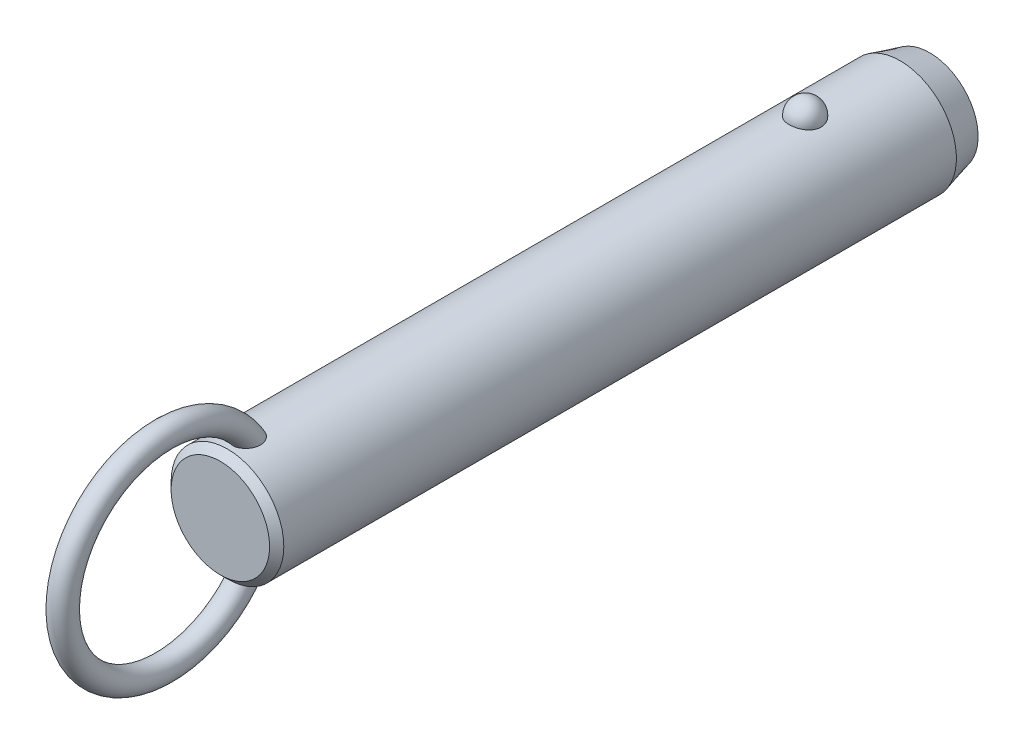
ISO-10303-21;
HEADER;
FILE_DESCRIPTION(('STEP AP214'),'2;1');
FILE_NAME('part.step','',(''),(''),'','','');
FILE_SCHEMA(('AUTOMOTIVE_DESIGN { 1 0 10303 214 1 1 1 1 }'));
ENDSEC;
DATA;
#1=APPLICATION_CONTEXT('core data for automotive mechanical design processes');
#2=APPLICATION_PROTOCOL_DEFINITION('international standard','automotive_design',2000,#1);
#3=PRODUCT_CONTEXT('',#1,'mechanical');
#4=PRODUCT('Part','Part','',(#3));
#5=PRODUCT_RELATED_PRODUCT_CATEGORY('part','',(#4));
#6=PRODUCT_DEFINITION_FORMATION('','',#4);
#7=PRODUCT_DEFINITION_CONTEXT('part definition',#1,'design');
#8=PRODUCT_DEFINITION('design','',#6,#7);
#9=PRODUCT_DEFINITION_SHAPE('','',#8);
#10=(LENGTH_UNIT() NAMED_UNIT(*) SI_UNIT(.MILLI.,.METRE.));
#11=(NAMED_UNIT(*) PLANE_ANGLE_UNIT() SI_UNIT($,.RADIAN.));
#12=(NAMED_UNIT(*) SI_UNIT($,.STERADIAN.) SOLID_ANGLE_UNIT());
#13=UNCERTAINTY_MEASURE_WITH_UNIT(LENGTH_MEASURE(1.E-05),#10,'distance_accuracy_value','');
#14=(GEOMETRIC_REPRESENTATION_CONTEXT(3) GLOBAL_UNCERTAINTY_ASSIGNED_CONTEXT((#13)) GLOBAL_UNIT_ASSIGNED_CONTEXT((#10,
#11,#12)) REPRESENTATION_CONTEXT('',''));
#15=CARTESIAN_POINT('',(0.,0.,0.));
#16=DIRECTION('',(0.,0.,1.));
#17=DIRECTION('',(1.,0.,0.));
#18=AXIS2_PLACEMENT_3D('',#15,#16,#17);
#19=CARTESIAN_POINT('',(0.,0.,86.4));
#20=DIRECTION('',(0.,0.,-1.));
#21=DIRECTION('',(-1.,0.,0.));
#22=AXIS2_PLACEMENT_3D('',#19,#20,#21);
#23=CYLINDRICAL_SURFACE('',#22,9.5);
#24=CARTESIAN_POINT('',(2.67259918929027,9.11631578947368,-2.70000000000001));
#25=CARTESIAN_POINT('',(2.6725968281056,9.11631786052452,-2.54909854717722));
#26=CARTESIAN_POINT('',(2.66030567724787,9.11994722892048,-2.39816735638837));
#27=CARTESIAN_POINT('',(2.6114347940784,9.13405924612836,-2.10058568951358));
#28=CARTESIAN_POINT('',(2.57484658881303,9.14454428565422,-1.95393672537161));
#29=CARTESIAN_POINT('',(2.47830875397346,9.17117631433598,-1.66916069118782));
#30=CARTESIAN_POINT('',(2.41836936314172,9.18732082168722,-1.53102991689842));
#31=CARTESIAN_POINT('',(2.27661331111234,9.22346780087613,-1.26705393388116));
#32=CARTESIAN_POINT('',(2.19479699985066,9.24347021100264,-1.14120852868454));
#33=CARTESIAN_POINT('',(2.01085282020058,9.28522401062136,-0.904632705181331));
#34=CARTESIAN_POINT('',(1.90862396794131,9.30698376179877,-0.793982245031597));
#35=CARTESIAN_POINT('',(1.6867437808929,9.34973971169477,-0.591607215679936));
#36=CARTESIAN_POINT('',(1.56709244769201,9.37073591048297,-0.499882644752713));
#37=CARTESIAN_POINT('',(1.31393976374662,9.40956370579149,-0.338167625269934));
#38=CARTESIAN_POINT('',(1.18048026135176,9.42740444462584,-0.268113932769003));
#39=CARTESIAN_POINT('',(0.903154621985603,9.45799906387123,-0.151390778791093));
#40=CARTESIAN_POINT('',(0.759289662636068,9.47075351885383,-0.10471867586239));
#41=CARTESIAN_POINT('',(0.46807402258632,9.48956256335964,-0.0367633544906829));
#42=CARTESIAN_POINT('',(0.320836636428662,9.49573643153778,-0.0150275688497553));
#43=CARTESIAN_POINT('',(0.02467145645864,9.50112183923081,0.00396199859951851));
#44=CARTESIAN_POINT('',(-0.124256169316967,9.50033406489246,0.00121819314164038));
#45=CARTESIAN_POINT('',(-0.417264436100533,9.4919475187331,-0.0284441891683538));
#46=CARTESIAN_POINT('',(-0.561384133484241,9.48444885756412,-0.055007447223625));
#47=CARTESIAN_POINT('',(-0.842986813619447,9.46357853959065,-0.131064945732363));
#48=CARTESIAN_POINT('',(-0.98046968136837,9.450206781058,-0.180559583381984));
#49=CARTESIAN_POINT('',(-1.24585005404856,9.41890822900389,-0.301476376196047));
#50=CARTESIAN_POINT('',(-1.37368611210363,9.40095498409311,-0.373026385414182));
#51=CARTESIAN_POINT('',(-1.61552738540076,9.36242964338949,-0.536025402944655));
#52=CARTESIAN_POINT('',(-1.72953116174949,9.34185727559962,-0.627476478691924));
#53=CARTESIAN_POINT('',(-1.9429225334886,9.29984568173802,-0.829844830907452));
#54=CARTESIAN_POINT('',(-2.04198021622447,9.27839736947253,-0.94110821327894));
#55=CARTESIAN_POINT('',(-2.2202646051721,9.23735994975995,-1.17883414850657));
#56=CARTESIAN_POINT('',(-2.29948985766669,9.21777097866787,-1.30529781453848));
#57=CARTESIAN_POINT('',(-2.43697287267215,9.18238994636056,-1.57158566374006));
#58=CARTESIAN_POINT('',(-2.49497068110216,9.16664569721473,-1.71155057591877));
#59=CARTESIAN_POINT('',(-2.5872073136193,9.14104303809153,-1.99961197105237));
#60=CARTESIAN_POINT('',(-2.62144683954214,9.13118445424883,-2.14770821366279));
#61=CARTESIAN_POINT('',(-2.66521466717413,9.11850622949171,-2.44715424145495));
#62=CARTESIAN_POINT('',(-2.67484831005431,9.11565658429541,-2.59848735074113));
#63=CARTESIAN_POINT('',(-2.66946735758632,9.11723375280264,-2.90067317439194));
#64=CARTESIAN_POINT('',(-2.65445345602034,9.12166036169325,-3.05152590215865));
#65=CARTESIAN_POINT('',(-2.60029711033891,9.13724422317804,-3.34766110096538));
#66=CARTESIAN_POINT('',(-2.56127978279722,9.14836656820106,-3.49296833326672));
#67=CARTESIAN_POINT('',(-2.46018844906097,9.17606676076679,-3.77477535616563));
#68=CARTESIAN_POINT('',(-2.39811349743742,9.1926448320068,-3.9112747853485));
#69=CARTESIAN_POINT('',(-2.25202303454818,9.22952198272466,-4.17244273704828));
#70=CARTESIAN_POINT('',(-2.16788714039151,9.24984129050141,-4.29704106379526));
#71=CARTESIAN_POINT('',(-1.9799408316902,9.29188255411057,-4.53013066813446));
#72=CARTESIAN_POINT('',(-1.87612963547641,9.31360456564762,-4.63862130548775));
#73=CARTESIAN_POINT('',(-1.65105429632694,9.35612959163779,-4.8369029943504));
#74=CARTESIAN_POINT('',(-1.52972405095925,9.37692871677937,-4.92661991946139));
#75=CARTESIAN_POINT('',(-1.27318250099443,9.41518970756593,-5.08429106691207));
#76=CARTESIAN_POINT('',(-1.13797219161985,9.432651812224,-5.15224684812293));
#77=CARTESIAN_POINT('',(-0.859280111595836,9.46208255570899,-5.26371827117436));
#78=CARTESIAN_POINT('',(-0.715925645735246,9.47411833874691,-5.30753421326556));
#79=CARTESIAN_POINT('',(-0.423550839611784,9.4916822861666,-5.37076321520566));
#80=CARTESIAN_POINT('',(-0.274531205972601,9.49721125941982,-5.39017930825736));
#81=CARTESIAN_POINT('',(0.021844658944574,9.50110860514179,-5.40390587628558));
#82=CARTESIAN_POINT('',(0.169177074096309,9.49961381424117,-5.39869609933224));
#83=CARTESIAN_POINT('',(0.460808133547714,9.48993906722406,-5.36441955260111));
#84=CARTESIAN_POINT('',(0.605106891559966,9.48175936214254,-5.33535367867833));
#85=CARTESIAN_POINT('',(0.886027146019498,9.4596376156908,-5.25435587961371));
#86=CARTESIAN_POINT('',(1.02267710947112,9.44571881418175,-5.20251612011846));
#87=CARTESIAN_POINT('',(1.28523827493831,9.41358993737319,-5.07741549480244));
#88=CARTESIAN_POINT('',(1.41114877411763,9.39537958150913,-5.00415322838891));
#89=CARTESIAN_POINT('',(1.65085227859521,9.3562644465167,-4.83684599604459));
#90=CARTESIAN_POINT('',(1.76442346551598,9.33532178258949,-4.74249218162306));
#91=CARTESIAN_POINT('',(1.97425672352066,9.29321198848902,-4.53620389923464));
#92=CARTESIAN_POINT('',(2.07051582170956,9.27204482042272,-4.42426641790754));
#93=CARTESIAN_POINT('',(2.24490086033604,9.23139221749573,-4.18363183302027));
#94=CARTESIAN_POINT('',(2.32267019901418,9.21194380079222,-4.05466990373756));
#95=CARTESIAN_POINT('',(2.45584092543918,9.1773419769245,-3.78517836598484));
#96=CARTESIAN_POINT('',(2.5112497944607,9.16218713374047,-3.64465264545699));
#97=CARTESIAN_POINT('',(2.59380876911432,9.13913522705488,-3.37104301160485));
#98=CARTESIAN_POINT('',(2.62330266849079,9.13064624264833,-3.23871053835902));
#99=CARTESIAN_POINT('',(2.66269870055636,9.11923566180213,-2.97092664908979));
#100=CARTESIAN_POINT('',(2.67260130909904,9.11631393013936,-2.83547530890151));
#101=CARTESIAN_POINT('',(2.67259918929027,9.11631578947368,-2.70000000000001));
#102=B_SPLINE_CURVE_WITH_KNOTS('',3,(#24,#25,#26,#27,#28,#29,#30,#31,#32,#33,#34,#35,#36,#37,
#38,#39,#40,#41,#42,#43,#44,#45,#46,#47,#48,#49,#50,#51,#52,#53,#54,#55,#56,#57,#58,#59,#60,#61,
#62,#63,#64,#65,#66,#67,#68,#69,#70,#71,#72,#73,#74,#75,#76,#77,#78,#79,#80,#81,#82,#83,#84,#85,
#86,#87,#88,#89,#90,#91,#92,#93,#94,#95,#96,#97,#98,#99,#100,#101),.UNSPECIFIED.,.T.,.F.,(4,2,2,
2,2,2,2,2,2,2,2,2,2,2,2,2,2,2,2,2,2,2,2,2,2,2,2,2,2,2,2,2,2,2,2,2,2,2,4),(0.,0.452217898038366,
0.904593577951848,1.35677112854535,1.80894144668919,2.26340676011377,2.71787203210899,
3.17099820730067,3.62407318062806,4.06878835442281,4.51345969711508,4.95160616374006,
5.38976021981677,5.83050358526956,6.27129275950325,6.72071308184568,7.17016633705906,
7.6249527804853,8.07972578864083,8.53254856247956,8.98535859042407,9.43582813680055,
9.88631615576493,10.3393155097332,10.7923328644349,11.2471065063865,11.7018475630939,
12.150795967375,12.599688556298,13.0398725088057,13.4800399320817,13.9184421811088,
14.3568730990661,14.802202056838,15.2476074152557,15.7010097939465,16.1542603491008,
16.5602594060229,16.966248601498),.UNSPECIFIED.);
#103=CARTESIAN_POINT('',(2.67259918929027,9.11631578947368,-2.70000000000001));
#104=VERTEX_POINT('',#103);
#105=EDGE_CURVE('E41',#104,#104,#102,.T.);
#106=ORIENTED_EDGE('',*,*,#105,.T.);
#107=EDGE_LOOP('',(#106));
#108=FACE_BOUND('',#107,.T.);
#109=CARTESIAN_POINT('',(0.,0.,94.7200000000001));
#110=DIRECTION('',(0.,0.,1.));
#111=DIRECTION('',(1.,0.,0.));
#112=AXIS2_PLACEMENT_3D('',#109,#110,#111);
#113=CIRCLE('',#112,9.5);
#114=CARTESIAN_POINT('',(9.5,0.,94.7200000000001));
#115=VERTEX_POINT('',#114);
#116=EDGE_CURVE('E10',#115,#115,#113,.F.);
#117=ORIENTED_EDGE('',*,*,#116,.T.);
#118=EDGE_LOOP('',(#117));
#119=FACE_BOUND('',#118,.T.);
#120=CARTESIAN_POINT('',(-0.697062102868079,-9.47439269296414,89.0678088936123));
#121=CARTESIAN_POINT('',(-0.799579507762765,-9.46685146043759,89.1074823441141));
#122=CARTESIAN_POINT('',(-0.898575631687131,-9.45788043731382,89.1559309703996));
#123=CARTESIAN_POINT('',(-1.08670047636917,-9.43811593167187,89.2688685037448));
#124=CARTESIAN_POINT('',(-1.17583204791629,-9.42732297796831,89.333352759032));
#125=CARTESIAN_POINT('',(-1.34179806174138,-9.40513672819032,89.4762099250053));
#126=CARTESIAN_POINT('',(-1.41865133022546,-9.39374438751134,89.5545611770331));
#127=CARTESIAN_POINT('',(-1.5586004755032,-9.37154196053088,89.7227524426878));
#128=CARTESIAN_POINT('',(-1.62169476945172,-9.3607319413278,89.8125937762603));
#129=CARTESIAN_POINT('',(-1.73527695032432,-9.34035749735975,90.0045001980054));
#130=CARTESIAN_POINT('',(-1.7852226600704,-9.33085270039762,90.1068910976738));
#131=CARTESIAN_POINT('',(-1.86924997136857,-9.3143834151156,90.318148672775));
#132=CARTESIAN_POINT('',(-1.90332570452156,-9.30741986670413,90.4270177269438));
#133=CARTESIAN_POINT('',(-1.95893603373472,-9.29588482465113,90.6604730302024));
#134=CARTESIAN_POINT('',(-1.97872420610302,-9.29165182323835,90.7854890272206));
#135=CARTESIAN_POINT('',(-2.00062129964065,-9.28695978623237,91.0370805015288));
#136=CARTESIAN_POINT('',(-2.00272284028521,-9.28650232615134,91.163656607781));
#137=CARTESIAN_POINT('',(-1.98958876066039,-9.28932750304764,91.4368157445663));
#138=CARTESIAN_POINT('',(-1.97143366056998,-9.2932400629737,91.5832519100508));
#139=CARTESIAN_POINT('',(-1.91479925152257,-9.30507151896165,91.8720629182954));
#140=CARTESIAN_POINT('',(-1.87629122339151,-9.31299607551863,92.014431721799));
#141=CARTESIAN_POINT('',(-1.77225683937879,-9.33340232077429,92.3151725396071));
#142=CARTESIAN_POINT('',(-1.70334898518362,-9.34641636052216,92.4723691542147));
#143=CARTESIAN_POINT('',(-1.58111062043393,-9.36759153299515,92.6975171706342));
#144=CARTESIAN_POINT('',(-1.53721459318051,-9.37492619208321,92.7707968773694));
#145=CARTESIAN_POINT('',(-1.44302631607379,-9.38988566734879,92.9130740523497));
#146=CARTESIAN_POINT('',(-1.39273721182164,-9.39751033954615,92.9820736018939));
#147=CARTESIAN_POINT('',(-1.26775962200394,-9.41530678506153,93.1369832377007));
#148=CARTESIAN_POINT('',(-1.19052326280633,-9.42548108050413,93.2208712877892));
#149=CARTESIAN_POINT('',(-1.02420241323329,-9.44499825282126,93.3760086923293));
#150=CARTESIAN_POINT('',(-0.935139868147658,-9.45434261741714,93.4472808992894));
#151=CARTESIAN_POINT('',(-0.766610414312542,-9.46930670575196,93.5586955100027));
#152=CARTESIAN_POINT('',(-0.689439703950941,-9.47529223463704,93.6022354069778));
#153=CARTESIAN_POINT('',(-0.528942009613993,-9.48560294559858,93.6763133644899));
#154=CARTESIAN_POINT('',(-0.445620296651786,-9.48992953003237,93.7068624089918));
#155=CARTESIAN_POINT('',(-0.273901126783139,-9.49644161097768,93.7525792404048));
#156=CARTESIAN_POINT('',(-0.185465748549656,-9.49860811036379,93.76761059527));
#157=CARTESIAN_POINT('',(-0.00734541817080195,-9.5004135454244,93.7801494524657));
#158=CARTESIAN_POINT('',(0.0823387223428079,-9.50005405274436,93.7776678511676));
#159=CARTESIAN_POINT('',(0.247679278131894,-9.49708301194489,93.7569959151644));
#160=CARTESIAN_POINT('',(0.323620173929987,-9.49477609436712,93.7409300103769));
#161=CARTESIAN_POINT('',(0.471981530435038,-9.48855917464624,93.6971726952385));
#162=CARTESIAN_POINT('',(0.544400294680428,-9.48464840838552,93.6694757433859));
#163=CARTESIAN_POINT('',(0.70894789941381,-9.47398336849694,93.5928026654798));
#164=CARTESIAN_POINT('',(0.799149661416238,-9.46671310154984,93.5397745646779));
#165=CARTESIAN_POINT('',(0.969783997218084,-9.45076225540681,93.4199731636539));
#166=CARTESIAN_POINT('',(1.05019415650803,-9.44207854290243,93.3531692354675));
#167=CARTESIAN_POINT('',(1.23092343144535,-9.42051459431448,93.1807596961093));
#168=CARTESIAN_POINT('',(1.32652499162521,-9.40733378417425,93.0702619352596));
#169=CARTESIAN_POINT('',(1.49893121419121,-9.38140745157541,92.8355614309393));
#170=CARTESIAN_POINT('',(1.57571616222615,-9.36866239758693,92.7113445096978));
#171=CARTESIAN_POINT('',(1.71285426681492,-9.34457644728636,92.4493891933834));
#172=CARTESIAN_POINT('',(1.77266365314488,-9.33328726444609,92.3113623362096));
#173=CARTESIAN_POINT('',(1.87239208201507,-9.31379209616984,92.0280515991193));
#174=CARTESIAN_POINT('',(1.9123015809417,-9.3055875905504,91.882764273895));
#175=CARTESIAN_POINT('',(1.9760418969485,-9.29228394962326,91.5620281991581));
#176=CARTESIAN_POINT('',(1.99587438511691,-9.28797202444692,91.3857248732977));
#177=CARTESIAN_POINT('',(2.0029570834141,-9.28645519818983,91.0324146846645));
#178=CARTESIAN_POINT('',(1.99025930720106,-9.28923895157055,90.8554093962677));
#179=CARTESIAN_POINT('',(1.93735479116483,-9.30038134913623,90.5563381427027));
#180=CARTESIAN_POINT('',(1.90576827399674,-9.30697680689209,90.4326679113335));
#181=CARTESIAN_POINT('',(1.82287484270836,-9.32356855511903,90.192329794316));
#182=CARTESIAN_POINT('',(1.7715821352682,-9.33356239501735,90.0756569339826));
#183=CARTESIAN_POINT('',(1.64885744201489,-9.35602275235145,89.8527061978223));
#184=CARTESIAN_POINT('',(1.57730995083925,-9.36850332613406,89.7464927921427));
#185=CARTESIAN_POINT('',(1.41543264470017,-9.39431873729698,89.5495530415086));
#186=CARTESIAN_POINT('',(1.32510883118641,-9.40765330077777,89.4588217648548));
#187=CARTESIAN_POINT('',(1.13846223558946,-9.43195720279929,89.3050334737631));
#188=CARTESIAN_POINT('',(1.04369890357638,-9.44302894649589,89.2400947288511));
#189=CARTESIAN_POINT('',(0.843965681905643,-9.46296805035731,89.1280388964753));
#190=CARTESIAN_POINT('',(0.739000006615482,-9.4718363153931,89.0809144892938));
#191=CARTESIAN_POINT('',(0.528175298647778,-9.48586140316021,89.0081173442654));
#192=CARTESIAN_POINT('',(0.422686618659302,-9.49119633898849,88.9814024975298));
#193=CARTESIAN_POINT('',(0.20859011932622,-9.49831365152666,88.9460137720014));
#194=CARTESIAN_POINT('',(0.0999817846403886,-9.500095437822,88.9373428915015));
#195=CARTESIAN_POINT('',(-0.126104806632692,-9.49988861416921,88.9383501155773));
#196=CARTESIAN_POINT('',(-0.243578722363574,-9.49757821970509,88.9495942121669));
#197=CARTESIAN_POINT('',(-0.474390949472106,-9.48885165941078,88.993167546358));
#198=CARTESIAN_POINT('',(-0.587729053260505,-9.48243528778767,89.0254978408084));
#199=CARTESIAN_POINT('',(-0.697062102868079,-9.47439269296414,89.0678088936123));
#200=B_SPLINE_CURVE_WITH_KNOTS('',3,(#120,#121,#122,#123,#124,#125,#126,#127,#128,#129,#130,
#131,#132,#133,#134,#135,#136,#137,#138,#139,#140,#141,#142,#143,#144,#145,#146,#147,#148,#149,
#150,#151,#152,#153,#154,#155,#156,#157,#158,#159,#160,#161,#162,#163,#164,#165,#166,#167,#168,
#169,#170,#171,#172,#173,#174,#175,#176,#177,#178,#179,#180,#181,#182,#183,#184,#185,#186,#187,
#188,#189,#190,#191,#192,#193,#194,#195,#196,#197,#198,#199),.UNSPECIFIED.,.T.,.F.,(4,2,2,2,2,2,
2,2,2,2,2,2,2,2,2,2,2,2,2,2,2,2,2,2,2,2,2,2,2,2,2,2,2,2,2,2,2,2,2,4),(0.,0.330119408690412,
0.660143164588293,0.989655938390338,1.31920659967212,1.66074728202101,2.00241415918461,
2.38088696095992,2.7595176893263,3.20065679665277,3.6424200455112,4.15620996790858,
4.4131416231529,4.66994734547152,5.01228664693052,5.35399933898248,5.61943037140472,
5.88463652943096,6.15215502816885,6.41950709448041,6.65144391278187,6.88349136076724,
7.19641200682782,7.51003602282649,7.94779711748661,8.38601491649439,8.83699707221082,
9.28819530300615,9.8177866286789,10.3465317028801,10.7284172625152,11.110028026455,
11.4938603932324,11.8775702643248,12.2220189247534,12.5663259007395,12.8915939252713,
13.2169159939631,13.5689650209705,13.9210316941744),.UNSPECIFIED.);
#201=CARTESIAN_POINT('',(-0.697062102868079,-9.47439269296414,89.0678088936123));
#202=VERTEX_POINT('',#201);
#203=EDGE_CURVE('E59',#202,#202,#200,.T.);
#204=ORIENTED_EDGE('',*,*,#203,.T.);
#205=EDGE_LOOP('',(#204));
#206=FACE_BOUND('',#205,.T.);
#207=CARTESIAN_POINT('',(-0.697062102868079,9.47439269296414,89.0678088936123));
#208=CARTESIAN_POINT('',(-0.597792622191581,9.48169483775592,89.0293956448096));
#209=CARTESIAN_POINT('',(-0.495106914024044,9.48766580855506,88.9991682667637));
#210=CARTESIAN_POINT('',(-0.285876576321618,9.49627648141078,88.9560327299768));
#211=CARTESIAN_POINT('',(-0.179324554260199,9.49890941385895,88.9431597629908));
#212=CARTESIAN_POINT('',(0.0344157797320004,9.50053798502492,88.9351666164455));
#213=CARTESIAN_POINT('',(0.141603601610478,9.49953613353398,88.9400341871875));
#214=CARTESIAN_POINT('',(0.353563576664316,9.49401038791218,88.9673654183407));
#215=CARTESIAN_POINT('',(0.458336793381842,9.48948807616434,88.98982117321));
#216=CARTESIAN_POINT('',(0.66249373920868,9.4774236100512,89.0516719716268));
#217=CARTESIAN_POINT('',(0.761881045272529,9.46988348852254,89.0910556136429));
#218=CARTESIAN_POINT('',(0.952608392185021,9.45260382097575,89.1856342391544));
#219=CARTESIAN_POINT('',(1.04394806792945,9.44286417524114,89.2408299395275));
#220=CARTESIAN_POINT('',(1.21712767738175,9.42211760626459,89.3660662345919));
#221=CARTESIAN_POINT('',(1.29885671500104,9.41109835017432,89.4362579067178));
#222=CARTESIAN_POINT('',(1.44978975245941,9.38903310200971,89.5889801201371));
#223=CARTESIAN_POINT('',(1.51899278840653,9.37798710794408,89.6715116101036));
#224=CARTESIAN_POINT('',(1.64602857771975,9.35654375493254,89.8497763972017));
#225=CARTESIAN_POINT('',(1.70333052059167,9.34618688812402,89.9458916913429));
#226=CARTESIAN_POINT('',(1.80259341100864,9.32755128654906,90.145897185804));
#227=CARTESIAN_POINT('',(1.84454942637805,9.31927322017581,90.2497898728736));
#228=CARTESIAN_POINT('',(1.91637039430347,9.30478365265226,90.472213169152));
#229=CARTESIAN_POINT('',(1.944805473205,9.29882552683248,90.5912192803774));
#230=CARTESIAN_POINT('',(1.98449865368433,9.29043398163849,90.8321436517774));
#231=CARTESIAN_POINT('',(1.99574908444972,9.28800213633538,90.9540631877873));
#232=CARTESIAN_POINT('',(2.00275141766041,9.28649645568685,91.2169324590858));
#233=CARTESIAN_POINT('',(1.99588238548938,9.28799035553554,91.3579529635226));
#234=CARTESIAN_POINT('',(1.96270559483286,9.29505517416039,91.6376217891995));
#235=CARTESIAN_POINT('',(1.93637872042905,9.30063010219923,91.776267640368));
#236=CARTESIAN_POINT('',(1.85949176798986,9.31633564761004,92.0725616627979));
#237=CARTESIAN_POINT('',(1.80549792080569,9.3270926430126,92.2292907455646));
#238=CARTESIAN_POINT('',(1.67376869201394,9.3516306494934,92.5322840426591));
#239=CARTESIAN_POINT('',(1.59603181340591,9.36541185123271,92.6785475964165));
#240=CARTESIAN_POINT('',(1.4360277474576,9.39110706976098,92.9258138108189));
#241=CARTESIAN_POINT('',(1.35831795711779,9.40278656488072,93.029791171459));
#242=CARTESIAN_POINT('',(1.18774483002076,9.42585025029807,93.2245347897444));
#243=CARTESIAN_POINT('',(1.09490932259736,9.43723493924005,93.3153247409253));
#244=CARTESIAN_POINT('',(0.921110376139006,9.45552616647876,93.4562033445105));
#245=CARTESIAN_POINT('',(0.843738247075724,9.46281058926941,93.5106563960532));
#246=CARTESIAN_POINT('',(0.681245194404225,9.47589120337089,93.6067117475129));
#247=CARTESIAN_POINT('',(0.596135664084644,9.48168953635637,93.6483325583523));
#248=CARTESIAN_POINT('',(0.433779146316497,9.49038144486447,93.7100899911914));
#249=CARTESIAN_POINT('',(0.357459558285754,9.49359170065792,93.7326013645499));
#250=CARTESIAN_POINT('',(0.202074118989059,9.49816761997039,93.7645745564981));
#251=CARTESIAN_POINT('',(0.123010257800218,9.49953459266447,93.7740456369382));
#252=CARTESIAN_POINT('',(-0.0357372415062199,9.50026497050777,93.7791143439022));
#253=CARTESIAN_POINT('',(-0.115421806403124,9.49962433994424,93.7746840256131));
#254=CARTESIAN_POINT('',(-0.272823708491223,9.49640854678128,93.7522962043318));
#255=CARTESIAN_POINT('',(-0.350540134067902,9.4938325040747,93.7343325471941));
#256=CARTESIAN_POINT('',(-0.500580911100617,9.4870946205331,93.6868028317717));
#257=CARTESIAN_POINT('',(-0.572979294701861,9.48296359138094,93.6574618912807));
#258=CARTESIAN_POINT('',(-0.712864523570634,9.47347609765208,93.5890087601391));
#259=CARTESIAN_POINT('',(-0.780349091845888,9.46811906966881,93.5498920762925));
#260=CARTESIAN_POINT('',(-0.946309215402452,9.45329720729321,93.439432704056));
#261=CARTESIAN_POINT('',(-1.04090230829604,9.44321512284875,93.3623297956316));
#262=CARTESIAN_POINT('',(-1.21661929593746,9.42219227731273,93.1940971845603));
#263=CARTESIAN_POINT('',(-1.29770519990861,9.41124921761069,93.1029292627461));
#264=CARTESIAN_POINT('',(-1.47319646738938,9.38563439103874,92.8761621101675));
#265=CARTESIAN_POINT('',(-1.56208878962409,9.37102009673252,92.7362895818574));
#266=CARTESIAN_POINT('',(-1.71623987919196,9.34401559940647,92.4439503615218));
#267=CARTESIAN_POINT('',(-1.78147866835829,9.33162728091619,92.291473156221));
#268=CARTESIAN_POINT('',(-1.88853837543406,9.31055541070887,91.9756470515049));
#269=CARTESIAN_POINT('',(-1.92998995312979,9.30193076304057,91.8121685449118));
#270=CARTESIAN_POINT('',(-1.98590726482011,9.29015757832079,91.4805268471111));
#271=CARTESIAN_POINT('',(-2.0004070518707,9.2870021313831,91.3123698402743));
#272=CARTESIAN_POINT('',(-1.99964701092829,9.28716218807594,91.0050806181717));
#273=CARTESIAN_POINT('',(-1.98908145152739,9.28945704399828,90.8659362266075));
#274=CARTESIAN_POINT('',(-1.94566294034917,9.29865169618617,90.5911539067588));
#275=CARTESIAN_POINT('',(-1.91282062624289,9.30554929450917,90.455514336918));
#276=CARTESIAN_POINT('',(-1.84582133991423,9.31898248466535,90.2578026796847));
#277=CARTESIAN_POINT('',(-1.82038084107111,9.32400364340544,90.192583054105));
#278=CARTESIAN_POINT('',(-1.76350511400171,9.33492884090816,90.0649033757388));
#279=CARTESIAN_POINT('',(-1.73207305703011,9.34083241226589,90.0024418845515));
#280=CARTESIAN_POINT('',(-1.6632424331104,9.353333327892,89.8809407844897));
#281=CARTESIAN_POINT('',(-1.62584239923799,9.35993084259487,89.8219020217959));
#282=CARTESIAN_POINT('',(-1.54527678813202,9.37356864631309,89.7079875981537));
#283=CARTESIAN_POINT('',(-1.50211241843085,9.38060884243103,89.6531110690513));
#284=CARTESIAN_POINT('',(-1.37681147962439,9.40004442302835,89.509961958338));
#285=CARTESIAN_POINT('',(-1.28916358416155,9.41261047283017,89.4264295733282));
#286=CARTESIAN_POINT('',(-1.09996826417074,9.43658180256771,89.2772360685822));
#287=CARTESIAN_POINT('',(-0.99846185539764,9.44799034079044,89.2115238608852));
#288=CARTESIAN_POINT('',(-0.860188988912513,9.46103017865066,89.1394367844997));
#289=CARTESIAN_POINT('',(-0.828141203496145,9.46389141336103,89.1238511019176));
#290=CARTESIAN_POINT('',(-0.763210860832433,9.46934915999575,89.0944734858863));
#291=CARTESIAN_POINT('',(-0.730328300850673,9.47194567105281,89.0806815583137));
#292=CARTESIAN_POINT('',(-0.697062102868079,9.47439269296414,89.0678088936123));
#293=B_SPLINE_CURVE_WITH_KNOTS('',3,(#207,#208,#209,#210,#211,#212,#213,#214,#215,#216,#217,
#218,#219,#220,#221,#222,#223,#224,#225,#226,#227,#228,#229,#230,#231,#232,#233,#234,#235,#236,
#237,#238,#239,#240,#241,#242,#243,#244,#245,#246,#247,#248,#249,#250,#251,#252,#253,#254,#255,
#256,#257,#258,#259,#260,#261,#262,#263,#264,#265,#266,#267,#268,#269,#270,#271,#272,#273,#274,
#275,#276,#277,#278,#279,#280,#281,#282,#283,#284,#285,#286,#287,#288,#289,#290,#291,#292),
.UNSPECIFIED.,.T.,.F.,(4,2,2,2,2,2,2,2,2,2,2,2,2,2,2,2,2,2,2,2,2,2,2,2,2,2,2,2,2,2,2,2,2,2,2,2,
2,2,2,2,2,2,4),(0.,0.31994216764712,0.640532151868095,0.960900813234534,1.28112555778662,
1.60113495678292,1.92115886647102,2.24457323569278,2.56801248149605,2.90371927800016,
3.23953387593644,3.60560313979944,3.97183576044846,4.39383693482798,4.81625324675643,
5.31257045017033,5.80891895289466,6.19868344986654,6.58773876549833,6.87145417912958,
7.15475838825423,7.3926375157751,7.63034760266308,7.86853584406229,8.10683246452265,
8.3406366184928,8.57454843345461,8.93983939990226,9.30614105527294,9.8026666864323,
10.2996107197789,10.8040753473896,11.3079021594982,11.7249776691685,12.1418541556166,
12.3521485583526,12.562331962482,12.7725671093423,12.9827582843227,13.345827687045,
13.7078449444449,13.8150604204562,13.9222762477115),.UNSPECIFIED.);
#294=CARTESIAN_POINT('',(-0.697062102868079,9.47439269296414,89.0678088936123));
#295=VERTEX_POINT('',#294);
#296=EDGE_CURVE('E67',#295,#295,#293,.T.);
#297=ORIENTED_EDGE('',*,*,#296,.T.);
#298=EDGE_LOOP('',(#297));
#299=FACE_BOUND('',#298,.T.);
#300=CARTESIAN_POINT('',(0.,0.,-18.7));
#301=DIRECTION('',(0.,0.,-1.));
#302=DIRECTION('',(-1.,0.,0.));
#303=AXIS2_PLACEMENT_3D('',#300,#301,#302);
#304=CIRCLE('',#303,9.5);
#305=CARTESIAN_POINT('',(-9.5,0.,-18.7));
#306=VERTEX_POINT('',#305);
#307=EDGE_CURVE('E56',#306,#306,#304,.F.);
#308=ORIENTED_EDGE('',*,*,#307,.T.);
#309=EDGE_LOOP('',(#308));
#310=FACE_BOUND('',#309,.T.);
#311=ADVANCED_FACE('F37',(#108,#119,#206,#299,#310),#23,.T.);
#312=CARTESIAN_POINT('',(0.,0.,-23.7));
#313=DIRECTION('',(0.,0.,-1.));
#314=DIRECTION('',(-1.,0.,0.));
#315=AXIS2_PLACEMENT_3D('',#312,#313,#314);
#316=PLANE('',#315);
#317=CARTESIAN_POINT('',(0.,0.,-23.7));
#318=DIRECTION('',(0.,0.,-1.));
#319=DIRECTION('',(-1.,0.,0.));
#320=AXIS2_PLACEMENT_3D('',#317,#318,#319);
#321=CIRCLE('',#320,8.1602540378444);
#322=CARTESIAN_POINT('',(-8.1602540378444,0.,-23.7));
#323=VERTEX_POINT('',#322);
#324=EDGE_CURVE('E66',#323,#323,#321,.T.);
#325=ORIENTED_EDGE('',*,*,#324,.T.);
#326=EDGE_LOOP('',(#325));
#327=FACE_BOUND('',#326,.T.);
#328=ADVANCED_FACE('F85',(#327),#316,.T.);
#329=CARTESIAN_POINT('',(0.,0.,-23.7));
#330=DIRECTION('',(0.,0.,1.));
#331=DIRECTION('',(1.,0.,0.));
#332=AXIS2_PLACEMENT_3D('',#329,#330,#331);
#333=CONICAL_SURFACE('',#332,8.1602540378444,0.26179938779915);
#334=ORIENTED_EDGE('',*,*,#307,.F.);
#335=EDGE_LOOP('',(#334));
#336=FACE_BOUND('',#335,.T.);
#337=ORIENTED_EDGE('',*,*,#324,.F.);
#338=EDGE_LOOP('',(#337));
#339=FACE_BOUND('',#338,.T.);
#340=ADVANCED_FACE('F83',(#336,#339),#333,.T.);
#341=CARTESIAN_POINT('',(0.,0.,95.92));
#342=DIRECTION('',(0.,0.,1.));
#343=DIRECTION('',(1.,0.,0.));
#344=AXIS2_PLACEMENT_3D('',#341,#342,#343);
#345=PLANE('',#344);
#346=CARTESIAN_POINT('',(0.,0.,95.92));
#347=DIRECTION('',(0.,0.,1.));
#348=DIRECTION('',(1.,0.,0.));
#349=AXIS2_PLACEMENT_3D('',#346,#347,#348);
#350=CIRCLE('',#349,8.30000000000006);
#351=CARTESIAN_POINT('',(8.30000000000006,0.,95.92));
#352=VERTEX_POINT('',#351);
#353=EDGE_CURVE('E50',#352,#352,#350,.T.);
#354=ORIENTED_EDGE('',*,*,#353,.T.);
#355=EDGE_LOOP('',(#354));
#356=FACE_BOUND('',#355,.T.);
#357=ADVANCED_FACE('F77',(#356),#345,.T.);
#358=CARTESIAN_POINT('',(0.,0.,105.45));
#359=DIRECTION('',(1.,0.,0.));
#360=DIRECTION('',(0.,0.,-1.));
#361=AXIS2_PLACEMENT_3D('',#358,#359,#360);
#362=TOROIDAL_SURFACE('',#361,17.05,2.);
#363=ORIENTED_EDGE('',*,*,#296,.F.);
#364=EDGE_LOOP('',(#363));
#365=FACE_BOUND('',#364,.T.);
#366=ORIENTED_EDGE('',*,*,#203,.F.);
#367=EDGE_LOOP('',(#366));
#368=FACE_BOUND('',#367,.T.);
#369=ADVANCED_FACE('F73',(#365,#368),#362,.T.);
#370=CARTESIAN_POINT('',(0.,0.,95.92));
#371=DIRECTION('',(0.,0.,-1.));
#372=DIRECTION('',(-1.,0.,0.));
#373=AXIS2_PLACEMENT_3D('',#370,#371,#372);
#374=CONICAL_SURFACE('',#373,8.30000000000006,0.785398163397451);
#375=ORIENTED_EDGE('',*,*,#116,.F.);
#376=EDGE_LOOP('',(#375));
#377=FACE_BOUND('',#376,.T.);
#378=ORIENTED_EDGE('',*,*,#353,.F.);
#379=EDGE_LOOP('',(#378));
#380=FACE_BOUND('',#379,.T.);
#381=ADVANCED_FACE('F39',(#377,#380),#374,.T.);
#382=CARTESIAN_POINT('',(0.,9.5,-2.70000000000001));
#383=DIRECTION('',(0.,1.,0.));
#384=DIRECTION('',(0.,0.,-1.));
#385=AXIS2_PLACEMENT_3D('',#382,#383,#384);
#386=SPHERICAL_SURFACE('',#385,2.7);
#387=ORIENTED_EDGE('',*,*,#105,.F.);
#388=EDGE_LOOP('',(#387));
#389=FACE_BOUND('',#388,.T.);
#390=ADVANCED_FACE('F79',(#389),#386,.T.);
#391=CLOSED_SHELL('',(#311,#328,#340,#357,#369,#381,#390));
#392=MANIFOLD_SOLID_BREP('B2',#391);
#393=ADVANCED_BREP_SHAPE_REPRESENTATION('',(#18,#392),#14);
#394=SHAPE_DEFINITION_REPRESENTATION(#9,#393);
ENDSEC;
END-ISO-10303-21;
